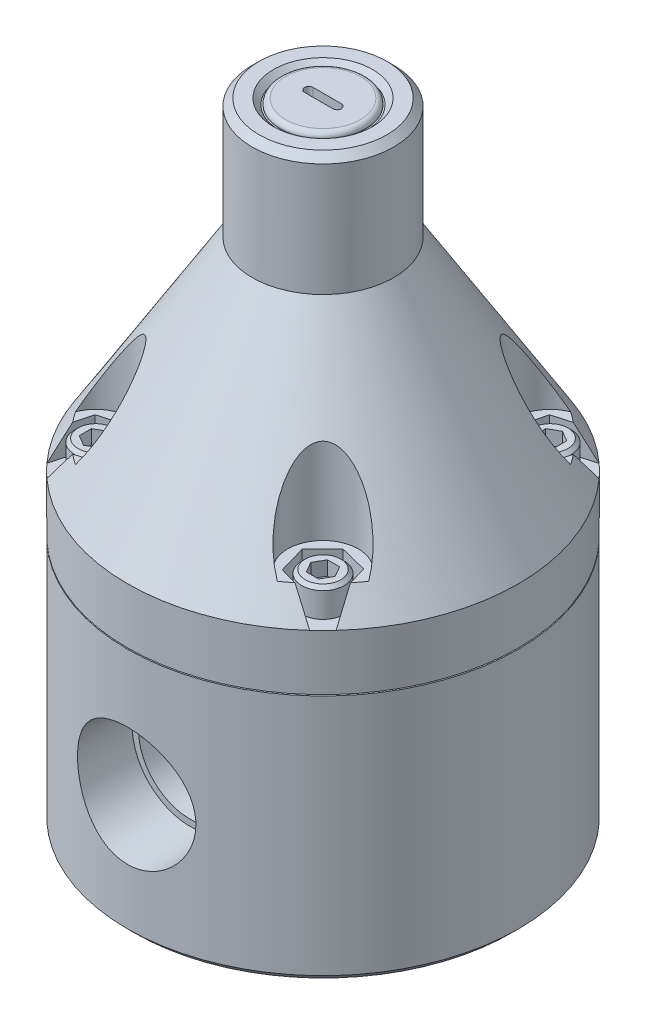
from build123d import *

# Parameters (mm, degrees)
SKETCH1_R         = 43.815
EXTRUDE1_DEPTH    = 140.97
SKETCH3_R         = 11.1125
EXTRUDE2_DEPTH    = 1.27
EXTRUDE2_DRAFT    = -45
CHAMFER1_SIZE     = 1.5748
SKETCH4_R         = 9.525
EXTRUDE3_DEPTH    = 1.27
FILLET1_R         = 1.143
EXTRUDE4_DEPTH    = 3.302
EXTRUDE4_DRAFT    = -1
SKETCH6_R         = 7.9375
EXTRUDE5_DEPTH    = 22.86
EXTRUDE6_DEPTH    = 6.35
CIRPATTERN1_COUNT = 4
SKETCH9_R         = 4.7625
EXTRUDE7_DEPTH    = 6.35
EXTRUDE8_DEPTH    = 3.175
CIRPATTERN2_COUNT = 4
CHAMFER2_SIZE     = 0.762


with BuildPart() as part:
    # Sketch1 → Extrude1 (new body)
    with BuildSketch(Plane(origin=(0, 0, 0), x_dir=(1, 0, 0), z_dir=(0, 1, 0))):
        with Locations(Location((0, 0, 0), (0, 0, 270))):
            Circle(SKETCH1_R)
    extrude(amount=EXTRUDE1_DEPTH)

    # Sketch2 → Cut-Revolve1 (revolve, cut)
    with BuildSketch(Plane.XY, mode=Mode.PRIVATE) as cut_revolve1_sk:
        Polygon((-43.815, 56.134), (-43.815, 68.58), (-15.875, 114.046), (-15.875, 147.034008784), (-49.44729897, 147.034008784), (-49.44729897, 55.88), (-30.226, 55.88), (-30.226, 56.134), align=None)
    revolve(cut_revolve1_sk.sketch.rotate(Axis((0, 0, 0), (0, 1, 0)), 270), axis=Axis((0, 0, 0), (0, 1, 0)), mode=Mode.SUBTRACT)


with BuildPart() as extrude2_tool:
    # Sketch3 → Extrude2 (with draft: the straight prism first)
    with BuildSketch(Plane(origin=(0, 140.97, 0), x_dir=(-1, 0, 0), z_dir=(0, 1, 0))):
        Circle(SKETCH3_R)
    extrude(amount=-EXTRUDE2_DEPTH)
    # Extrude2: the draft: its side faces are tilted about the plane it starts from
    extrude2_sides = [extrude2_tool.faces().sort_by_distance(p)[0] for p in [
        (11.1125, 140.335, 0),
    ]]
    draft(extrude2_sides, Plane(origin=(0, 140.97, 0), x_dir=(-1, 0, 0), z_dir=(0, 1, 0)), EXTRUDE2_DRAFT)


with BuildPart() as part_1:
    add(part.part)

    # Extrude2: cut by extrude2_tool
    add(extrude2_tool.part, mode=Mode.SUBTRACT)

    # Chamfer1
    chamfer1_edges = [part_1.edges().sort_by_distance(p)[0] for p in [
        (0, 0, -43.815),
        (0, 140.97, 15.875),
    ]]
    chamfer(chamfer1_edges, length=CHAMFER1_SIZE)

    # Sketch4 → Extrude3 (add)
    with BuildSketch(Plane(origin=(0, 140.97, 0), x_dir=(-1, 0, 0), z_dir=(0, 1, 0))):
        with Locations(Location((0, 0, 0), (0, 0, 90))):
            Circle(SKETCH4_R)
    extrude(amount=-EXTRUDE3_DEPTH)

    # Fillet1
    fillet1_edges = [part_1.edges().sort_by_distance(p)[0] for p in [
        (0, 140.97, -9.525),
    ]]
    fillet(fillet1_edges, radius=FILLET1_R)


with BuildPart() as extrude4_tool:
    # Sketch5 → Extrude4 (with draft: the straight prism first)
    with BuildSketch(Plane(origin=(0, 140.97, 0), x_dir=(-1, 0, 0), z_dir=(0, 1, 0))):
        with BuildLine():
            Line((3.175, 0.9652), (-3.175, 0.9652))
            ThreePointArc((-3.175, 0.9652), (-4.1402, 0), (-3.175, -0.9652))
            Line((-3.175, -0.9652), (3.175, -0.9652))
            ThreePointArc((3.175, -0.9652), (4.1402, 0), (3.175, 0.9652))
        make_face()
    extrude(amount=-EXTRUDE4_DEPTH)
    # Extrude4: the draft: its side faces are tilted about the plane it starts from
    extrude4_sides = [extrude4_tool.faces().sort_by_distance(p)[0] for p in [
        (-4.1402, 139.319, 0),
        (0, 139.319, 0.9652),
        (4.1402, 139.319, 0),
        (0, 139.319, -0.9652),
    ]]
    draft(extrude4_sides, Plane(origin=(0, 140.97, 0), x_dir=(-1, 0, 0), z_dir=(0, 1, 0)), EXTRUDE4_DRAFT)


with BuildPart() as part_2:
    add(part_1.part)

    # Extrude4: cut by extrude4_tool
    add(extrude4_tool.part, mode=Mode.SUBTRACT)

    # Sketch6 → Extrude5 (cut)
    with BuildSketch(Plane(origin=(0, 74.93, 0), x_dir=(-1, 0, 0), z_dir=(0, 1, 0))):
        with Locations((-25.459026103, 25.459026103)):
            Circle(SKETCH6_R)
    extrude5 = extrude(amount=EXTRUDE5_DEPTH, mode=Mode.SUBTRACT)

    # Sketch8 → Extrude6 (cut)
    with BuildSketch(Plane(origin=(0, 74.93, 0), x_dir=(-1, 0, 0), z_dir=(0, 1, 0))):
        Polygon((-29.948607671, 20.824591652), (-23.690278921, 19.253717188), (-19.200697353, 23.888151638), (-20.969444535, 30.093460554), (-33.591654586, 33.591654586), align=None)
    extrude6 = extrude(amount=-EXTRUDE6_DEPTH, mode=Mode.SUBTRACT)

    # CirPattern1: Extrude5, Extrude6 ×4 about axis
    cirpattern1_axis = Axis((0, 0, 0), (0, 1, 0))
    add([extrude5.rotate(cirpattern1_axis, i * 360 / CIRPATTERN1_COUNT) for i in range(1, CIRPATTERN1_COUNT)], mode=Mode.SUBTRACT)
    add([extrude6.rotate(cirpattern1_axis, i * 360 / CIRPATTERN1_COUNT) for i in range(1, CIRPATTERN1_COUNT)], mode=Mode.SUBTRACT)

    # Sketch9 → Extrude7 (add)
    with BuildSketch(Plane(origin=(0, 74.93, 0), x_dir=(-1, 0, 0), z_dir=(0, 1, 0))):
        with Locations(Location((-25.459026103, 25.459026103, 0), (0, 0, 90))):
            Circle(SKETCH9_R)
    extrude7 = extrude(amount=-EXTRUDE7_DEPTH)

    # Sketch10 → Extrude8 (cut)
    with BuildSketch(Plane(origin=(0, 74.93, 0), x_dir=(-1, 0, 0), z_dir=(0, 1, 0))):
        Polygon((-28.187127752, 25.459026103), (-26.823076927, 23.096420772), (-24.094975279, 23.096420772), (-22.730924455, 25.459026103), (-24.094975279, 27.821631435), (-26.823076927, 27.821631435), align=None)
    extrude8 = extrude(amount=-EXTRUDE8_DEPTH, mode=Mode.SUBTRACT)

    # CirPattern2: Extrude7, Extrude8 ×4 about axis
    cirpattern2_axis = Axis((0, 0, 0), (0, 1, 0))
    add([extrude7.rotate(cirpattern2_axis, i * 360 / CIRPATTERN2_COUNT) for i in range(1, CIRPATTERN2_COUNT)])
    add([extrude8.rotate(cirpattern2_axis, i * 360 / CIRPATTERN2_COUNT) for i in range(1, CIRPATTERN2_COUNT)], mode=Mode.SUBTRACT)

    # Chamfer2
    chamfer2_edges = [part_2.edges().sort_by_distance(p)[0] for p in [
        (25.459026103, 74.93, 20.696526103),
        (-20.696526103, 74.93, 25.459026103),
        (-25.459026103, 74.93, -20.696526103),
        (20.696526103, 74.93, -25.459026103),
    ]]
    chamfer(chamfer2_edges, length=CHAMFER2_SIZE)

    # Sketch14 → 3_4 NPT Tapped Hole2 (revolve, cut)
    with BuildSketch(Plane(origin=(0, 27.432, 43.815), x_dir=(0, -1, 0), z_dir=(1, 0, 0))):
        Polygon((0, 0), (0, 27.880024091), (11.5062, 23.114), (11.5062, 13.97), (12.914204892, 13.97), (13.3324854, 0), align=None)
    f_3_4_npt_tapped_hole2 = revolve(axis=Axis((0, 27.432, 50.165), (0, 0, -1)), mode=Mode.SUBTRACT)

    # Mirror1: 3_4 NPT Tapped Hole2 across plane
    add(f_3_4_npt_tapped_hole2.mirror(Plane.XY), mode=Mode.SUBTRACT)

    # Sketch17 → 3_4 NPT Tapped Hole1 (revolve, cut)
    with BuildSketch(Plane(origin=(0, 0, 0), x_dir=(0, 0, -1), z_dir=(1, 0, 0))):
        Polygon((0, 0), (0, 25.975598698), (4.7625, 23.114), (4.7625, 13.97), (12.914204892, 13.97), (13.3324854, 0), align=None)
    revolve(axis=Axis((0, -6.35, 0), (0, 1, 0)), mode=Mode.SUBTRACT)


solid = part_2.part
